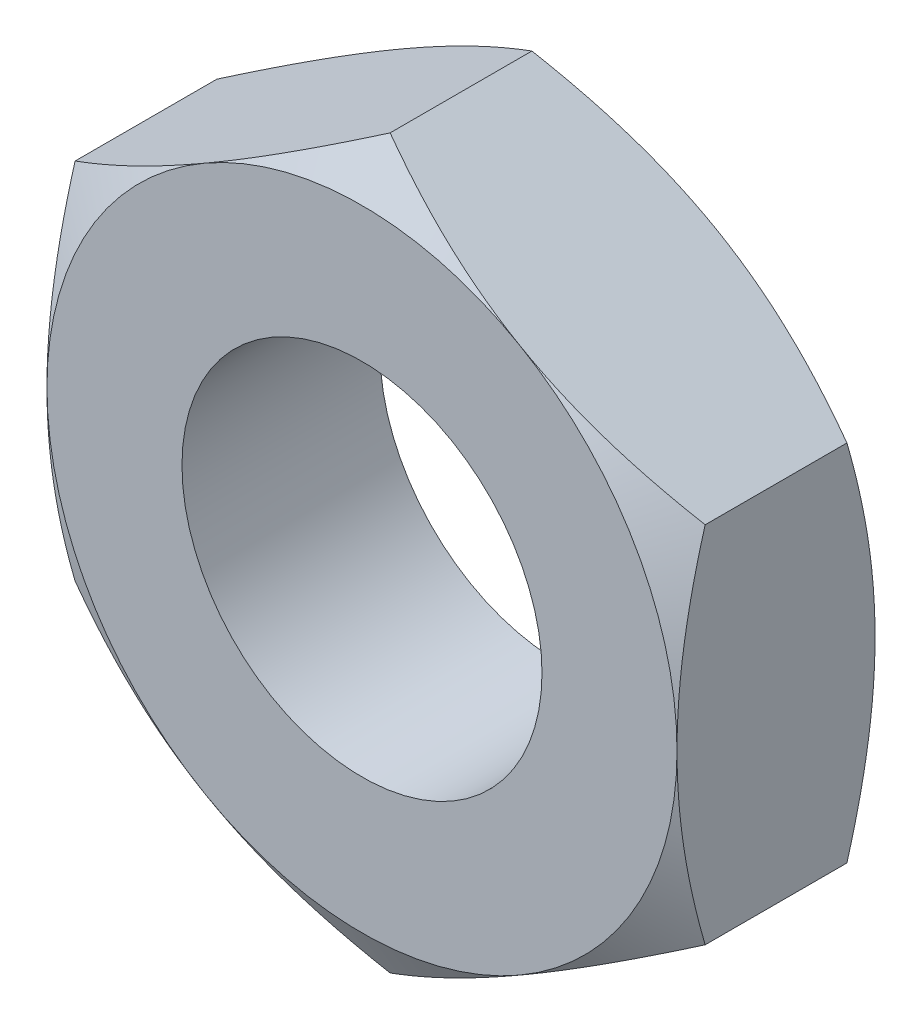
from build123d import *

# Parameters (mm, degrees)
BASE_EXTRUSION_DEPTH    = 2.2
ESQUISSE3_R             = 2
ENL_V_MAT_EXTRU_1_DEPTH = 2.2


with BuildPart() as part:
    # Esquisse1 → Base-Extrusion (new body)
    with BuildSketch(Plane.XY):
        Polygon((3.5, -2.020725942), (3.5, 2.020725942), (0, 4.041451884), (-3.5, 2.020725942), (-3.5, -2.020725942), (0, -4.041451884), align=None)
    extrude(amount=-BASE_EXTRUSION_DEPTH)

    # Esquisse2 → Enl_vement de mati_re-R_volution1 (revolve, cut)
    with BuildSketch(Plane(origin=(0, 0, 0), x_dir=(1, 0, 0), z_dir=(0, 1, 0)), mode=Mode.PRIVATE) as enl_vement_de_mati_re_r_volution1_sk:
        Polygon((-3.5, 0), (-6.405255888, 0), (-6.405255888, 2.2), (-3.5, 2.2), (-5.405255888, 1.1), align=None)
    revolve(enl_vement_de_mati_re_r_volution1_sk.sketch.rotate(Axis((0, 0, -2.2), (0, 0, 1)), 180), axis=Axis((0, 0, -2.2), (0, 0, 1)), mode=Mode.SUBTRACT)

    # Esquisse3 → Enl_v. mat.-Extru.1 (cut)
    with BuildSketch(Plane.XY):
        Circle(ESQUISSE3_R)
    extrude(amount=-ENL_V_MAT_EXTRU_1_DEPTH, mode=Mode.SUBTRACT)


solid = part.part
